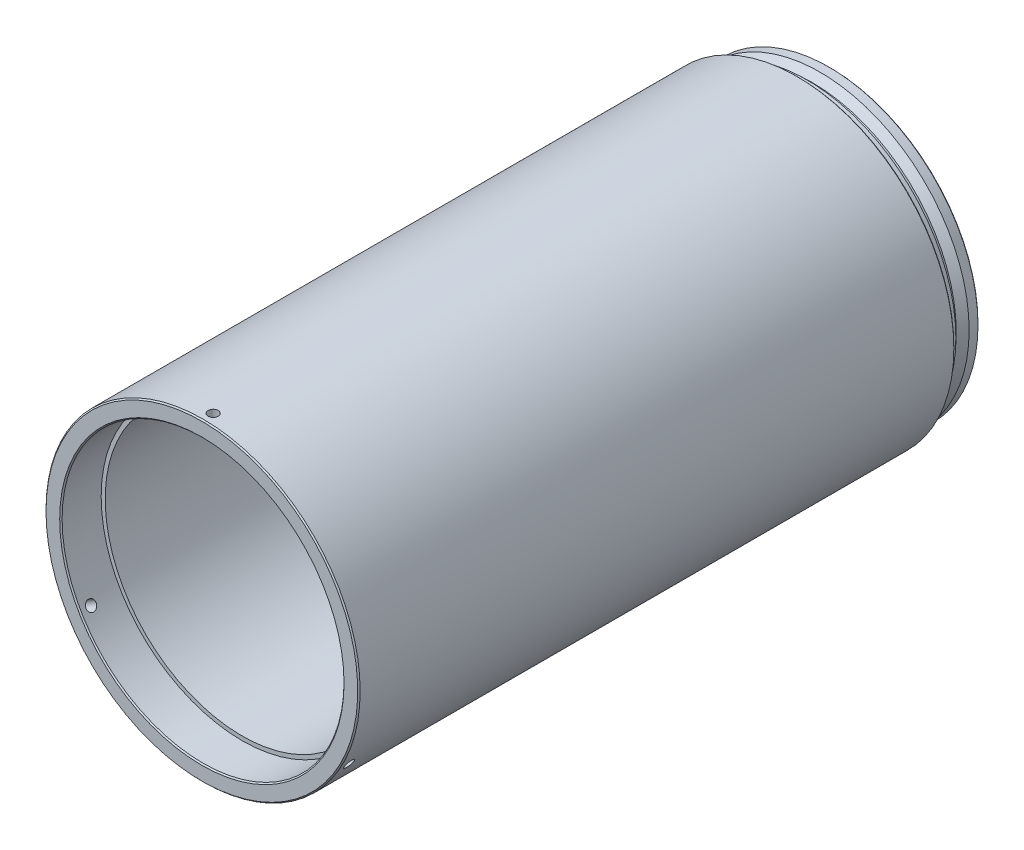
ISO-10303-21;
HEADER;
FILE_DESCRIPTION(('STEP AP214'),'2;1');
FILE_NAME('part.step','',(''),(''),'','','');
FILE_SCHEMA(('AUTOMOTIVE_DESIGN { 1 0 10303 214 1 1 1 1 }'));
ENDSEC;
DATA;
#1=APPLICATION_CONTEXT('core data for automotive mechanical design processes');
#2=APPLICATION_PROTOCOL_DEFINITION('international standard','automotive_design',2000,#1);
#3=PRODUCT_CONTEXT('',#1,'mechanical');
#4=PRODUCT('Part','Part','',(#3));
#5=PRODUCT_RELATED_PRODUCT_CATEGORY('part','',(#4));
#6=PRODUCT_DEFINITION_FORMATION('','',#4);
#7=PRODUCT_DEFINITION_CONTEXT('part definition',#1,'design');
#8=PRODUCT_DEFINITION('design','',#6,#7);
#9=PRODUCT_DEFINITION_SHAPE('','',#8);
#10=(LENGTH_UNIT() NAMED_UNIT(*) SI_UNIT(.MILLI.,.METRE.));
#11=(NAMED_UNIT(*) PLANE_ANGLE_UNIT() SI_UNIT($,.RADIAN.));
#12=(NAMED_UNIT(*) SI_UNIT($,.STERADIAN.) SOLID_ANGLE_UNIT());
#13=UNCERTAINTY_MEASURE_WITH_UNIT(LENGTH_MEASURE(1.E-05),#10,'distance_accuracy_value','');
#14=(GEOMETRIC_REPRESENTATION_CONTEXT(3) GLOBAL_UNCERTAINTY_ASSIGNED_CONTEXT((#13)) GLOBAL_UNIT_ASSIGNED_CONTEXT((#10,
#11,#12)) REPRESENTATION_CONTEXT('',''));
#15=CARTESIAN_POINT('',(0.,0.,0.));
#16=DIRECTION('',(0.,0.,1.));
#17=DIRECTION('',(1.,0.,0.));
#18=AXIS2_PLACEMENT_3D('',#15,#16,#17);
#19=CARTESIAN_POINT('',(0.,0.,-98.5429803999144));
#20=DIRECTION('',(0.,0.,1.));
#21=DIRECTION('',(1.,0.,0.));
#22=AXIS2_PLACEMENT_3D('',#19,#20,#21);
#23=CYLINDRICAL_SURFACE('',#22,35.);
#24=CARTESIAN_POINT('',(0.,0.,-81.584113));
#25=DIRECTION('',(0.,0.,-1.));
#26=DIRECTION('',(-1.,0.,0.));
#27=AXIS2_PLACEMENT_3D('',#24,#25,#26);
#28=CIRCLE('',#27,35.);
#29=CARTESIAN_POINT('',(-35.,0.,-81.584113));
#30=VERTEX_POINT('',#29);
#31=EDGE_CURVE('E9',#30,#30,#28,.F.);
#32=ORIENTED_EDGE('',*,*,#31,.T.);
#33=EDGE_LOOP('',(#32));
#34=FACE_BOUND('',#33,.T.);
#35=CARTESIAN_POINT('',(30.3108891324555,-17.4999999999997,-82.834113));
#36=CARTESIAN_POINT('',(30.2757943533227,-17.5607853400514,-82.8341161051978));
#37=CARTESIAN_POINT('',(30.240490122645,-17.6215078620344,-82.8400446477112));
#38=CARTESIAN_POINT('',(30.1705003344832,-17.7410745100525,-82.8636115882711));
#39=CARTESIAN_POINT('',(30.1358155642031,-17.7999163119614,-82.8812639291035));
#40=CARTESIAN_POINT('',(30.0681387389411,-17.9140009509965,-82.9277738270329));
#41=CARTESIAN_POINT('',(30.0351458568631,-17.9692455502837,-82.9566258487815));
#42=CARTESIAN_POINT('',(29.9718512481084,-18.0746207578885,-83.0247080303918));
#43=CARTESIAN_POINT('',(29.9415488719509,-18.1247526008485,-83.063935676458));
#44=CARTESIAN_POINT('',(29.8845544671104,-18.2185735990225,-83.151681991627));
#45=CARTESIAN_POINT('',(29.8578642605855,-18.2622595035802,-83.200205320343));
#46=CARTESIAN_POINT('',(29.8089607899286,-18.3419750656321,-83.305156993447));
#47=CARTESIAN_POINT('',(29.7867477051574,-18.3780044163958,-83.3615856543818));
#48=CARTESIAN_POINT('',(29.7475142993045,-18.4414421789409,-83.4807623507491));
#49=CARTESIAN_POINT('',(29.7304952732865,-18.4688484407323,-83.5435119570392));
#50=CARTESIAN_POINT('',(29.7022173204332,-18.5142919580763,-83.6735381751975));
#51=CARTESIAN_POINT('',(29.6909583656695,-18.5323292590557,-83.7408147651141));
#52=CARTESIAN_POINT('',(29.6745783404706,-18.5585463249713,-83.8779545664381));
#53=CARTESIAN_POINT('',(29.6694546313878,-18.5667303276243,-83.9478166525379));
#54=CARTESIAN_POINT('',(29.6655076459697,-18.5730361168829,-84.0881698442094));
#55=CARTESIAN_POINT('',(29.6666843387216,-18.5711579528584,-84.1586609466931));
#56=CARTESIAN_POINT('',(29.6752966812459,-18.5573929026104,-84.2982373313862));
#57=CARTESIAN_POINT('',(29.6827294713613,-18.5455105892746,-84.3673232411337));
#58=CARTESIAN_POINT('',(29.7036023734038,-18.5120607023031,-84.5021624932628));
#59=CARTESIAN_POINT('',(29.7170425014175,-18.4904931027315,-84.5679158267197));
#60=CARTESIAN_POINT('',(29.749489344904,-18.4382435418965,-84.6942407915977));
#61=CARTESIAN_POINT('',(29.7684973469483,-18.4075594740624,-84.7548112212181));
#62=CARTESIAN_POINT('',(29.8114576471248,-18.3379023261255,-84.869037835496));
#63=CARTESIAN_POINT('',(29.8354099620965,-18.2989292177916,-84.9226939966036));
#64=CARTESIAN_POINT('',(29.8875031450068,-18.2137213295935,-85.021600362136));
#65=CARTESIAN_POINT('',(29.9156463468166,-18.1674825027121,-85.0668458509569));
#66=CARTESIAN_POINT('',(29.9752220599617,-18.0690167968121,-85.1476102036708));
#67=CARTESIAN_POINT('',(30.0066545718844,-18.0167899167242,-85.1831290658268));
#68=CARTESIAN_POINT('',(30.0718370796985,-17.9077816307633,-85.2434314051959));
#69=CARTESIAN_POINT('',(30.1055871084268,-17.8510001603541,-85.26821473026));
#70=CARTESIAN_POINT('',(30.1743847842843,-17.7344601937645,-85.3063394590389));
#71=CARTESIAN_POINT('',(30.2094324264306,-17.6747017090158,-85.3196809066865));
#72=CARTESIAN_POINT('',(30.2797752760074,-17.553919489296,-85.3345373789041));
#73=CARTESIAN_POINT('',(30.3150703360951,-17.4928964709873,-85.3360589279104));
#74=CARTESIAN_POINT('',(30.3849206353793,-17.3712842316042,-85.3272494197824));
#75=CARTESIAN_POINT('',(30.4194758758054,-17.310695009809,-85.3169183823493));
#76=CARTESIAN_POINT('',(30.486883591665,-17.1917016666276,-85.2847023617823));
#77=CARTESIAN_POINT('',(30.5197365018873,-17.1332969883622,-85.2628203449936));
#78=CARTESIAN_POINT('',(30.58287253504,-17.0203436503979,-85.2081265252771));
#79=CARTESIAN_POINT('',(30.6131556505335,-16.9657950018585,-85.1753146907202));
#80=CARTESIAN_POINT('',(30.6703834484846,-16.8621200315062,-85.0996758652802));
#81=CARTESIAN_POINT('',(30.6973266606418,-16.8129960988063,-85.0568444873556));
#82=CARTESIAN_POINT('',(30.7471856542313,-16.7216413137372,-84.9623888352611));
#83=CARTESIAN_POINT('',(30.7701014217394,-16.6794104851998,-84.9107645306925));
#84=CARTESIAN_POINT('',(30.8113581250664,-16.6030750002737,-84.8001604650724));
#85=CARTESIAN_POINT('',(30.8296969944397,-16.5689740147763,-84.7411773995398));
#86=CARTESIAN_POINT('',(30.8613509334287,-16.5099408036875,-84.6175469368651));
#87=CARTESIAN_POINT('',(30.8746660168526,-16.4850085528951,-84.5528995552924));
#88=CARTESIAN_POINT('',(30.8959593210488,-16.4450665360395,-84.4197913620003));
#89=CARTESIAN_POINT('',(30.903938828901,-16.430054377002,-84.3513314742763));
#90=CARTESIAN_POINT('',(30.9143822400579,-16.4103959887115,-84.2125285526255));
#91=CARTESIAN_POINT('',(30.9168461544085,-16.405749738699,-84.1421855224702));
#92=CARTESIAN_POINT('',(30.9162021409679,-16.4069633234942,-84.0016551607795));
#93=CARTESIAN_POINT('',(30.9130973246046,-16.4128172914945,-83.9314677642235));
#94=CARTESIAN_POINT('',(30.9013929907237,-16.4348430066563,-83.7932016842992));
#95=CARTESIAN_POINT('',(30.8927934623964,-16.451014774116,-83.7251230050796));
#96=CARTESIAN_POINT('',(30.8702976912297,-16.4931891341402,-83.5930047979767));
#97=CARTESIAN_POINT('',(30.8564013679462,-16.5191918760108,-83.5289653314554));
#98=CARTESIAN_POINT('',(30.8236367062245,-16.5802477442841,-83.4067433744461));
#99=CARTESIAN_POINT('',(30.8047685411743,-16.6153005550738,-83.3485606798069));
#100=CARTESIAN_POINT('',(30.7624990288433,-16.693430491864,-83.2396721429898));
#101=CARTESIAN_POINT('',(30.7390956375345,-16.7365112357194,-83.1889696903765));
#102=CARTESIAN_POINT('',(30.6883239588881,-16.8294256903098,-83.0964980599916));
#103=CARTESIAN_POINT('',(30.6609546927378,-16.8792610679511,-83.0547310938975));
#104=CARTESIAN_POINT('',(30.6029261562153,-16.9842429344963,-82.9813060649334));
#105=CARTESIAN_POINT('',(30.572264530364,-17.0393932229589,-82.9496553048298));
#106=CARTESIAN_POINT('',(30.5084849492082,-17.1533259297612,-82.8974328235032));
#107=CARTESIAN_POINT('',(30.475369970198,-17.2121039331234,-82.8768479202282));
#108=CARTESIAN_POINT('',(30.4201818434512,-17.309373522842,-82.8527836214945));
#109=CARTESIAN_POINT('',(30.3985733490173,-17.3472955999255,-82.845790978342));
#110=CARTESIAN_POINT('',(30.3549672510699,-17.423486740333,-82.8364546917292));
#111=CARTESIAN_POINT('',(30.3329696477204,-17.4617558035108,-82.8341110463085));
#112=CARTESIAN_POINT('',(30.3108891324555,-17.4999999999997,-82.834113));
#113=B_SPLINE_CURVE_WITH_KNOTS('',3,(#35,#36,#37,#38,#39,#40,#41,#42,#43,#44,#45,#46,#47,#48,
#49,#50,#51,#52,#53,#54,#55,#56,#57,#58,#59,#60,#61,#62,#63,#64,#65,#66,#67,#68,#69,#70,#71,#72,
#73,#74,#75,#76,#77,#78,#79,#80,#81,#82,#83,#84,#85,#86,#87,#88,#89,#90,#91,#92,#93,#94,#95,#96,
#97,#98,#99,#100,#101,#102,#103,#104,#105,#106,#107,#108,#109,#110,#111,#112),.UNSPECIFIED.,.T.,
.F.,(4,2,2,2,2,2,2,2,2,2,2,2,2,2,2,2,2,2,2,2,2,2,2,2,2,2,2,2,2,2,2,2,2,2,2,2,2,2,4),(0.,
0.210405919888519,0.421062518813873,0.631615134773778,0.842116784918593,1.05272422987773,
1.26334011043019,1.4740084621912,1.68467579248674,1.89525248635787,2.1058281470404,
2.31630760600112,2.5267876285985,2.73731632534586,2.94784573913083,3.15849283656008,
3.36913997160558,3.57979009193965,3.79043940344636,4.00097243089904,4.21150510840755,
4.4219837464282,4.63246299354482,4.84303457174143,5.0536068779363,5.26427408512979,
5.47494071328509,5.68555650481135,5.89617187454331,6.10666960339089,6.31716774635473,
6.52766908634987,6.73816308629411,6.94875217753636,7.15939333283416,7.3701862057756,
7.58072741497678,7.71310816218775,7.84548885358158),.UNSPECIFIED.);
#114=CARTESIAN_POINT('',(30.3108891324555,-17.4999999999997,-82.834113));
#115=VERTEX_POINT('',#114);
#116=EDGE_CURVE('E210',#115,#115,#113,.T.);
#117=ORIENTED_EDGE('',*,*,#116,.T.);
#118=EDGE_LOOP('',(#117));
#119=FACE_BOUND('',#118,.T.);
#120=CARTESIAN_POINT('',(-30.3108891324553,-17.5000000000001,-82.834113));
#121=CARTESIAN_POINT('',(-30.3459833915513,-17.439214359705,-82.8341161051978));
#122=CARTESIAN_POINT('',(-30.3809185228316,-17.3782787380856,-82.8400446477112));
#123=CARTESIAN_POINT('',(-30.4494713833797,-17.257882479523,-82.8636115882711));
#124=CARTESIAN_POINT('',(-30.4830874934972,-17.1984236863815,-82.8812639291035));
#125=CARTESIAN_POINT('',(-30.5480492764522,-17.0827715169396,-82.9277738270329));
#126=CARTESIAN_POINT('',(-30.5793960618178,-17.0265765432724,-82.9566258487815));
#127=CARTESIAN_POINT('',(-30.6390063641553,-16.9190742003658,-83.0247080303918));
#128=CARTESIAN_POINT('',(-30.6672706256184,-16.8677656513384,-83.063935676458));
#129=CARTESIAN_POINT('',(-30.7200247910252,-16.771496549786,-83.151681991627));
#130=CARTESIAN_POINT('',(-30.7445127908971,-16.7265392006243,-83.200205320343));
#131=CARTESIAN_POINT('',(-30.7890967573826,-16.6443297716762,-83.305156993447));
#132=CARTESIAN_POINT('',(-30.8091925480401,-16.6070780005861,-83.3615856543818));
#133=CARTESIAN_POINT('',(-30.844514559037,-16.5413819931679,-83.4807623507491));
#134=CARTESIAN_POINT('',(-30.8597395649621,-16.512939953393,-83.5435119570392));
#135=CARTESIAN_POINT('',(-30.8849558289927,-16.4657287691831,-83.6735381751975));
#136=CARTESIAN_POINT('',(-30.8949471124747,-16.4469595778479,-83.7408147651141));
#137=CARTESIAN_POINT('',(-30.9094617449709,-16.4196655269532,-83.8779545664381));
#138=CARTESIAN_POINT('',(-30.9139874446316,-16.4111362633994,-83.9478166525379));
#139=CARTESIAN_POINT('',(-30.9174749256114,-16.4045651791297,-84.0881698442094));
#140=CARTESIAN_POINT('',(-30.9164367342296,-16.4065233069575,-84.1586609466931));
#141=CARTESIAN_POINT('',(-30.9088220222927,-16.4208643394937,-84.2982373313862));
#142=CARTESIAN_POINT('',(-30.9022480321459,-16.4332424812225,-84.3673232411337));
#143=CARTESIAN_POINT('',(-30.883716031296,-16.4680438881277,-84.5021624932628));
#144=CARTESIAN_POINT('',(-30.8717580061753,-16.4904671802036,-84.5679158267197));
#145=CARTESIAN_POINT('',(-30.8427319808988,-16.5446917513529,-84.6942407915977));
#146=CARTESIAN_POINT('',(-30.8256627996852,-16.5764951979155,-84.7548112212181));
#147=CARTESIAN_POINT('',(-30.7868180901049,-16.648528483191,-84.8690378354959));
#148=CARTESIAN_POINT('',(-30.7650425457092,-16.6887583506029,-84.9226939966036));
#149=CARTESIAN_POINT('',(-30.717296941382,-16.7764763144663,-85.021600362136));
#150=CARTESIAN_POINT('',(-30.6913245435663,-16.8239684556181,-85.0668458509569));
#151=CARTESIAN_POINT('',(-30.6358385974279,-16.9247953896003,-85.1476102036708));
#152=CARTESIAN_POINT('',(-30.6063250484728,-16.9781301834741,-85.1831290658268));
#153=CARTESIAN_POINT('',(-30.5445123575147,-17.0890840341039,-85.2434314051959));
#154=CARTESIAN_POINT('',(-30.5122131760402,-17.1467031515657,-85.26821473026));
#155=CARTESIAN_POINT('',(-30.4456854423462,-17.2645536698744,-85.3063394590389));
#156=CARTESIAN_POINT('',(-30.4114568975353,-17.3247850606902,-85.3196809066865));
#157=CARTESIAN_POINT('',(-30.3420278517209,-17.4460948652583,-85.3345373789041));
#158=CARTESIAN_POINT('',(-30.3068278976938,-17.5071727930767,-85.3360589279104));
#159=CARTESIAN_POINT('',(-30.236433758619,-17.6284710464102,-85.3272494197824));
#160=CARTESIAN_POINT('',(-30.2012395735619,-17.6886913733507,-85.3169183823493));
#161=CARTESIAN_POINT('',(-30.1318921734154,-17.8065648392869,-85.2847023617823));
#162=CARTESIAN_POINT('',(-30.0977386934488,-17.8642186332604,-85.2628203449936));
#163=CARTESIAN_POINT('',(-30.0314862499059,-17.9753727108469,-85.2081265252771));
#164=CARTESIAN_POINT('',(-29.9993872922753,-18.0288729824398,-85.1753146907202));
#165=CARTESIAN_POINT('',(-29.9382160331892,-18.1302711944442,-85.0996758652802));
#166=CARTESIAN_POINT('',(-29.9091450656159,-18.1781666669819,-85.0568444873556));
#167=CARTESIAN_POINT('',(-29.8549589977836,-18.267023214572,-84.9623888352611));
#168=CARTESIAN_POINT('',(-29.8298439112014,-18.30798426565,-84.9107645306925));
#169=CARTESIAN_POINT('',(-29.7843637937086,-18.3818813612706,-84.8001604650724));
#170=CARTESIAN_POINT('',(-29.7640009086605,-18.4148137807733,-84.7411773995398));
#171=CARTESIAN_POINT('',(-29.7287036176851,-18.471743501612,-84.6175469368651));
#172=CARTESIAN_POINT('',(-29.7137691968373,-18.4957408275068,-84.5528995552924));
#173=CARTESIAN_POINT('',(-29.6898250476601,-18.534152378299,-84.4197913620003));
#174=CARTESIAN_POINT('',(-29.6808138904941,-18.5485689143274,-84.3513314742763));
#175=CARTESIAN_POINT('',(-29.6690109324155,-18.5674423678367,-84.2125285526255));
#176=CARTESIAN_POINT('',(-29.6662191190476,-18.5718993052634,-84.1421855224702));
#177=CARTESIAN_POINT('',(-29.6669481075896,-18.5707347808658,-84.0016551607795));
#178=CARTESIAN_POINT('',(-29.6704653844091,-18.5651189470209,-83.9314677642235));
#179=CARTESIAN_POINT('',(-29.6836880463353,-18.5439698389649,-83.7932016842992));
#180=CARTESIAN_POINT('',(-29.6933934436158,-18.528436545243,-83.7251230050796));
#181=CARTESIAN_POINT('',(-29.7186696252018,-18.4878674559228,-83.5930047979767));
#182=CARTESIAN_POINT('',(-29.7342404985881,-18.4628315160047,-83.5289653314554));
#183=CARTESIAN_POINT('',(-29.770734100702,-18.4039285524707,-83.4067433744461));
#184=CARTESIAN_POINT('',(-29.7916566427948,-18.3700618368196,-83.3485606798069));
#185=CARTESIAN_POINT('',(-29.8381843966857,-18.2943903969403,-83.2396721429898));
#186=CARTESIAN_POINT('',(-29.863791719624,-18.2525820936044,-83.1889696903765));
#187=CARTESIAN_POINT('',(-29.9188721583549,-18.1621553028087,-83.0964980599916));
#188=CARTESIAN_POINT('',(-29.9483462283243,-18.113535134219,-83.0547310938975));
#189=CARTESIAN_POINT('',(-30.010248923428,-18.0107900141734,-82.9813060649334));
#190=CARTESIAN_POINT('',(-30.0426796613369,-17.9566611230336,-82.9496553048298));
#191=CARTESIAN_POINT('',(-30.1094584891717,-17.8444600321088,-82.8974328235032));
#192=CARTESIAN_POINT('',(-30.143804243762,-17.7863926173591,-82.8768479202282));
#193=CARTESIAN_POINT('',(-30.2004481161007,-17.6899635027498,-82.8527836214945));
#194=CARTESIAN_POINT('',(-30.2224853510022,-17.6522889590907,-82.845790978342));
#195=CARTESIAN_POINT('',(-30.2666657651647,-17.5764294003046,-82.8364546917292));
#196=CARTESIAN_POINT('',(-30.288808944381,-17.5382443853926,-82.8341110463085));
#197=CARTESIAN_POINT('',(-30.3108891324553,-17.5000000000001,-82.834113));
#198=B_SPLINE_CURVE_WITH_KNOTS('',3,(#120,#121,#122,#123,#124,#125,#126,#127,#128,#129,#130,
#131,#132,#133,#134,#135,#136,#137,#138,#139,#140,#141,#142,#143,#144,#145,#146,#147,#148,#149,
#150,#151,#152,#153,#154,#155,#156,#157,#158,#159,#160,#161,#162,#163,#164,#165,#166,#167,#168,
#169,#170,#171,#172,#173,#174,#175,#176,#177,#178,#179,#180,#181,#182,#183,#184,#185,#186,#187,
#188,#189,#190,#191,#192,#193,#194,#195,#196,#197),.UNSPECIFIED.,.T.,.F.,(4,2,2,2,2,2,2,2,2,2,2,
2,2,2,2,2,2,2,2,2,2,2,2,2,2,2,2,2,2,2,2,2,2,2,2,2,2,2,4),(0.,0.210405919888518,
0.421062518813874,0.631615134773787,0.842116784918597,1.05272422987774,1.26334011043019,
1.4740084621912,1.68467579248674,1.89525248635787,2.1058281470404,2.31630760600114,
2.52678762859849,2.73731632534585,2.94784573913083,3.15849283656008,3.36913997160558,
3.57979009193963,3.79043940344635,4.00097243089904,4.21150510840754,4.4219837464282,
4.63246299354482,4.84303457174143,5.0536068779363,5.2642740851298,5.47494071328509,
5.68555650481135,5.89617187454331,6.10666960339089,6.31716774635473,6.52766908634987,
6.73816308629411,6.94875217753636,7.15939333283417,7.37018620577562,7.58072741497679,
7.71310816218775,7.84548885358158),.UNSPECIFIED.);
#199=CARTESIAN_POINT('',(-30.3108891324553,-17.5000000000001,-82.834113));
#200=VERTEX_POINT('',#199);
#201=EDGE_CURVE('E184',#200,#200,#198,.T.);
#202=ORIENTED_EDGE('',*,*,#201,.T.);
#203=EDGE_LOOP('',(#202));
#204=FACE_BOUND('',#203,.T.);
#205=CARTESIAN_POINT('',(0.,35.,-82.834113));
#206=CARTESIAN_POINT('',(0.0701890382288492,34.9999996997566,-82.8341161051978));
#207=CARTESIAN_POINT('',(0.140428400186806,34.9997866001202,-82.8400446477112));
#208=CARTESIAN_POINT('',(0.278971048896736,34.9989569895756,-82.8636115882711));
#209=CARTESIAN_POINT('',(0.347271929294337,34.998339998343,-82.8812639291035));
#210=CARTESIAN_POINT('',(0.479910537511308,34.9967724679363,-82.9277738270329));
#211=CARTESIAN_POINT('',(0.544250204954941,34.9958220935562,-82.9566258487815));
#212=CARTESIAN_POINT('',(0.667155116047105,34.9936949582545,-83.0247080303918));
#213=CARTESIAN_POINT('',(0.72572175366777,34.992518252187,-83.063935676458));
#214=CARTESIAN_POINT('',(0.835470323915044,34.9900701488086,-83.151681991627));
#215=CARTESIAN_POINT('',(0.886648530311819,34.9887987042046,-83.200205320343));
#216=CARTESIAN_POINT('',(0.980135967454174,34.9863048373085,-83.305156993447));
#217=CARTESIAN_POINT('',(1.02244484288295,34.985082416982,-83.3615856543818));
#218=CARTESIAN_POINT('',(1.09700025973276,34.982824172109,-83.4807623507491));
#219=CARTESIAN_POINT('',(1.12924429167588,34.9817883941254,-83.5435119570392));
#220=CARTESIAN_POINT('',(1.18273850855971,34.9800207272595,-83.6735381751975));
#221=CARTESIAN_POINT('',(1.20398874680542,34.9792888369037,-83.7408147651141));
#222=CARTESIAN_POINT('',(1.23488340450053,34.9782118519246,-83.8779545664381));
#223=CARTESIAN_POINT('',(1.24453281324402,34.9778665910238,-83.9478166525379));
#224=CARTESIAN_POINT('',(1.25196727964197,34.9776012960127,-84.0881698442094));
#225=CARTESIAN_POINT('',(1.2497523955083,34.977681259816,-84.1586609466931));
#226=CARTESIAN_POINT('',(1.23352534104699,34.9782572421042,-84.2982373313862));
#227=CARTESIAN_POINT('',(1.21951856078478,34.9787530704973,-84.3673232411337));
#228=CARTESIAN_POINT('',(1.1801136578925,34.9801045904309,-84.5021624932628));
#229=CARTESIAN_POINT('',(1.15471550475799,34.9809602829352,-84.5679158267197));
#230=CARTESIAN_POINT('',(1.09324263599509,34.9829352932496,-84.6942407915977));
#231=CARTESIAN_POINT('',(1.05716545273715,34.9840546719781,-84.7548112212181));
#232=CARTESIAN_POINT('',(0.975360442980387,34.9864308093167,-84.869037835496));
#233=CARTESIAN_POINT('',(0.929632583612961,34.9876875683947,-84.9226939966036));
#234=CARTESIAN_POINT('',(0.829793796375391,34.99019764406,-85.021600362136));
#235=CARTESIAN_POINT('',(0.775678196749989,34.9914509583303,-85.0668458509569));
#236=CARTESIAN_POINT('',(0.660616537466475,34.9938121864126,-85.1476102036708));
#237=CARTESIAN_POINT('',(0.599670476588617,34.9949201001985,-85.1831290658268));
#238=CARTESIAN_POINT('',(0.472675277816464,34.9968656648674,-85.2434314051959));
#239=CARTESIAN_POINT('',(0.406626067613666,34.9977033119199,-85.26821473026));
#240=CARTESIAN_POINT('',(0.271300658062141,34.9990138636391,-85.3063394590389));
#241=CARTESIAN_POINT('',(0.202024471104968,34.9994867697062,-85.3196809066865));
#242=CARTESIAN_POINT('',(0.0622525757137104,35.0000143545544,-85.3345373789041));
#243=CARTESIAN_POINT('',(-0.0082424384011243,35.0000692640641,-85.3360589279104));
#244=CARTESIAN_POINT('',(-0.148486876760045,34.9997552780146,-85.3272494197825));
#245=CARTESIAN_POINT('',(-0.218236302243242,34.9993863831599,-85.3169183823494));
#246=CARTESIAN_POINT('',(-0.354991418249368,34.9982665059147,-85.2847023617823));
#247=CARTESIAN_POINT('',(-0.421997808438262,34.9975156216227,-85.2628203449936));
#248=CARTESIAN_POINT('',(-0.551386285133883,34.995716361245,-85.2081265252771));
#249=CARTESIAN_POINT('',(-0.613768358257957,34.9946679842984,-85.1753146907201));
#250=CARTESIAN_POINT('',(-0.73216741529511,34.9923912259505,-85.0996758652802));
#251=CARTESIAN_POINT('',(-0.788181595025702,34.9911627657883,-85.0568444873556));
#252=CARTESIAN_POINT('',(-0.892226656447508,34.9886645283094,-84.9623888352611));
#253=CARTESIAN_POINT('',(-0.940257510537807,34.9873947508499,-84.9107645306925));
#254=CARTESIAN_POINT('',(-1.02699433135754,34.9849563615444,-84.8001604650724));
#255=CARTESIAN_POINT('',(-1.06569608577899,34.9837877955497,-84.7411773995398));
#256=CARTESIAN_POINT('',(-1.13264731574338,34.9816843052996,-84.6175469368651));
#257=CARTESIAN_POINT('',(-1.16089682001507,34.980749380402,-84.5528995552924));
#258=CARTESIAN_POINT('',(-1.20613427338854,34.9792189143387,-84.4197913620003));
#259=CARTESIAN_POINT('',(-1.22312493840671,34.9786232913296,-84.3513314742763));
#260=CARTESIAN_POINT('',(-1.24537130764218,34.9778383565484,-84.2125285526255));
#261=CARTESIAN_POINT('',(-1.25062703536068,34.9776490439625,-84.1421855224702));
#262=CARTESIAN_POINT('',(-1.2492540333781,34.9776981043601,-84.0016551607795));
#263=CARTESIAN_POINT('',(-1.2426319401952,34.9779362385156,-83.9314677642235));
#264=CARTESIAN_POINT('',(-1.2177049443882,34.9788128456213,-83.7932016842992));
#265=CARTESIAN_POINT('',(-1.19940001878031,34.9794513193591,-83.7251230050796));
#266=CARTESIAN_POINT('',(-1.15162806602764,34.9810565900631,-83.5930047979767));
#267=CARTESIAN_POINT('',(-1.12216086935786,34.9820233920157,-83.5289653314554));
#268=CARTESIAN_POINT('',(-1.05290260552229,34.984176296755,-83.4067433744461));
#269=CARTESIAN_POINT('',(-1.01311189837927,34.9853623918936,-83.3485606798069));
#270=CARTESIAN_POINT('',(-0.924314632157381,34.9878208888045,-83.2396721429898));
#271=CARTESIAN_POINT('',(-0.875303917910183,34.989093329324,-83.1889696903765));
#272=CARTESIAN_POINT('',(-0.769451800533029,34.9915809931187,-83.0964980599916));
#273=CARTESIAN_POINT('',(-0.71260846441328,34.9927962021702,-83.0547310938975));
#274=CARTESIAN_POINT('',(-0.592677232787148,34.9950329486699,-82.9813060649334));
#275=CARTESIAN_POINT('',(-0.529584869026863,34.9960543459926,-82.9496553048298));
#276=CARTESIAN_POINT('',(-0.399026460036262,34.9977859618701,-82.8974328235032));
#277=CARTESIAN_POINT('',(-0.331565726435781,34.9984965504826,-82.8768479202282));
#278=CARTESIAN_POINT('',(-0.219733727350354,34.9993370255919,-82.8527836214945));
#279=CARTESIAN_POINT('',(-0.176087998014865,34.9995845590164,-82.845790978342));
#280=CARTESIAN_POINT('',(-0.0883014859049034,34.9999161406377,-82.8364546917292));
#281=CARTESIAN_POINT('',(-0.0441607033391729,35.0000001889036,-82.8341110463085));
#282=CARTESIAN_POINT('',(0.,35.,-82.834113));
#283=B_SPLINE_CURVE_WITH_KNOTS('',3,(#205,#206,#207,#208,#209,#210,#211,#212,#213,#214,#215,
#216,#217,#218,#219,#220,#221,#222,#223,#224,#225,#226,#227,#228,#229,#230,#231,#232,#233,#234,
#235,#236,#237,#238,#239,#240,#241,#242,#243,#244,#245,#246,#247,#248,#249,#250,#251,#252,#253,
#254,#255,#256,#257,#258,#259,#260,#261,#262,#263,#264,#265,#266,#267,#268,#269,#270,#271,#272,
#273,#274,#275,#276,#277,#278,#279,#280,#281,#282),.UNSPECIFIED.,.T.,.F.,(4,2,2,2,2,2,2,2,2,2,2,
2,2,2,2,2,2,2,2,2,2,2,2,2,2,2,2,2,2,2,2,2,2,2,2,2,2,2,4),(0.,0.210405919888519,
0.421062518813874,0.631615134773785,0.842116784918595,1.05272422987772,1.26334011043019,
1.47400846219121,1.68467579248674,1.89525248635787,2.1058281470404,2.31630760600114,
2.5267876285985,2.73731632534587,2.94784573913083,3.15849283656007,3.36913997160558,
3.57979009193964,3.79043940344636,4.00097243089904,4.21150510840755,4.42198374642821,
4.63246299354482,4.84303457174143,5.0536068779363,5.2642740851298,5.47494071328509,
5.68555650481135,5.89617187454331,6.10666960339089,6.31716774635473,6.52766908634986,
6.73816308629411,6.94875217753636,7.15939333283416,7.3701862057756,7.58072741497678,
7.71310816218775,7.84548885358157),.UNSPECIFIED.);
#284=CARTESIAN_POINT('',(0.,35.,-82.834113));
#285=VERTEX_POINT('',#284);
#286=EDGE_CURVE('E81',#285,#285,#283,.T.);
#287=ORIENTED_EDGE('',*,*,#286,.T.);
#288=EDGE_LOOP('',(#287));
#289=FACE_BOUND('',#288,.T.);
#290=CARTESIAN_POINT('',(0.,0.,-91.284113));
#291=DIRECTION('',(0.,0.,1.));
#292=DIRECTION('',(1.,0.,0.));
#293=AXIS2_PLACEMENT_3D('',#290,#291,#292);
#294=CIRCLE('',#293,35.);
#295=CARTESIAN_POINT('',(35.,0.,-91.284113));
#296=VERTEX_POINT('',#295);
#297=EDGE_CURVE('E70',#296,#296,#294,.T.);
#298=ORIENTED_EDGE('',*,*,#297,.F.);
#299=EDGE_LOOP('',(#298));
#300=FACE_BOUND('',#299,.T.);
#301=ADVANCED_FACE('F14',(#34,#119,#204,#289,#300),#23,.F.);
#302=CARTESIAN_POINT('',(0.,35.,-81.284113));
#303=DIRECTION('',(0.,0.,-1.));
#304=DIRECTION('',(-1.,0.,0.));
#305=AXIS2_PLACEMENT_3D('',#302,#303,#304);
#306=PLANE('',#305);
#307=CARTESIAN_POINT('',(0.,0.,-81.284113));
#308=DIRECTION('',(0.,0.,-1.));
#309=DIRECTION('',(-1.,0.,0.));
#310=AXIS2_PLACEMENT_3D('',#307,#308,#309);
#311=CIRCLE('',#310,38.7);
#312=CARTESIAN_POINT('',(-38.7,0.,-81.284113));
#313=VERTEX_POINT('',#312);
#314=EDGE_CURVE('E21',#313,#313,#311,.F.);
#315=ORIENTED_EDGE('',*,*,#314,.T.);
#316=EDGE_LOOP('',(#315));
#317=FACE_BOUND('',#316,.T.);
#318=CARTESIAN_POINT('',(0.,0.,-81.284113));
#319=DIRECTION('',(0.,0.,-1.));
#320=DIRECTION('',(-1.,0.,0.));
#321=AXIS2_PLACEMENT_3D('',#318,#319,#320);
#322=CIRCLE('',#321,35.3);
#323=CARTESIAN_POINT('',(-35.3,0.,-81.284113));
#324=VERTEX_POINT('',#323);
#325=EDGE_CURVE('E25',#324,#324,#322,.T.);
#326=ORIENTED_EDGE('',*,*,#325,.T.);
#327=EDGE_LOOP('',(#326));
#328=FACE_BOUND('',#327,.T.);
#329=ADVANCED_FACE('F140',(#317,#328),#306,.F.);
#330=CARTESIAN_POINT('',(0.,0.,-98.5429803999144));
#331=DIRECTION('',(0.,0.,1.));
#332=DIRECTION('',(1.,0.,0.));
#333=AXIS2_PLACEMENT_3D('',#330,#331,#332);
#334=CYLINDRICAL_SURFACE('',#333,39.);
#335=CARTESIAN_POINT('',(0.,0.,-228.988506));
#336=DIRECTION('',(0.,0.,1.));
#337=DIRECTION('',(1.,0.,0.));
#338=AXIS2_PLACEMENT_3D('',#335,#336,#337);
#339=CIRCLE('',#338,39.);
#340=CARTESIAN_POINT('',(39.,0.,-228.988506));
#341=VERTEX_POINT('',#340);
#342=EDGE_CURVE('E40',#341,#341,#339,.T.);
#343=ORIENTED_EDGE('',*,*,#342,.T.);
#344=EDGE_LOOP('',(#343));
#345=FACE_BOUND('',#344,.T.);
#346=CARTESIAN_POINT('',(0.,0.,-81.584113));
#347=DIRECTION('',(0.,0.,-1.));
#348=DIRECTION('',(-1.,0.,0.));
#349=AXIS2_PLACEMENT_3D('',#346,#347,#348);
#350=CIRCLE('',#349,39.);
#351=CARTESIAN_POINT('',(-39.,0.,-81.584113));
#352=VERTEX_POINT('',#351);
#353=EDGE_CURVE('E43',#352,#352,#350,.T.);
#354=ORIENTED_EDGE('',*,*,#353,.T.);
#355=EDGE_LOOP('',(#354));
#356=FACE_BOUND('',#355,.T.);
#357=CARTESIAN_POINT('',(33.7749907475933,-19.4999999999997,-82.834113));
#358=CARTESIAN_POINT('',(33.8100873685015,-19.4392103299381,-82.8341161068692));
#359=CARTESIAN_POINT('',(33.8450437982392,-19.3782814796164,-82.8400454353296));
#360=CARTESIAN_POINT('',(33.913675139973,-19.2579192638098,-82.8636156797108));
#361=CARTESIAN_POINT('',(33.9473484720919,-19.1984877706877,-82.8812705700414));
#362=CARTESIAN_POINT('',(34.0124543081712,-19.0829072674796,-82.9277876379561));
#363=CARTESIAN_POINT('',(34.043887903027,-19.0267566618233,-82.9566443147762));
#364=CARTESIAN_POINT('',(34.1036914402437,-18.9193555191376,-83.0247378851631));
#365=CARTESIAN_POINT('',(34.1320621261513,-18.8681037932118,-83.0639722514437));
#366=CARTESIAN_POINT('',(34.1850346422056,-18.7719584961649,-83.151730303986));
#367=CARTESIAN_POINT('',(34.2096348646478,-18.7270676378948,-83.2002579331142));
#368=CARTESIAN_POINT('',(34.2544384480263,-18.6449896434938,-83.3052179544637));
#369=CARTESIAN_POINT('',(34.2746416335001,-18.607802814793,-83.3616506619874));
#370=CARTESIAN_POINT('',(34.3101604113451,-18.5422298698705,-83.480831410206));
#371=CARTESIAN_POINT('',(34.3254750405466,-18.5138454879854,-83.5435806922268));
#372=CARTESIAN_POINT('',(34.3508437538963,-18.4667336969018,-83.6736045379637));
#373=CARTESIAN_POINT('',(34.3608978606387,-18.4480062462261,-83.7408790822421));
#374=CARTESIAN_POINT('',(34.3755048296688,-18.4207738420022,-83.878019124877));
#375=CARTESIAN_POINT('',(34.3800595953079,-18.4122653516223,-83.9478837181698));
#376=CARTESIAN_POINT('',(34.3835670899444,-18.4057145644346,-84.0882411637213));
#377=CARTESIAN_POINT('',(34.3825198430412,-18.4076722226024,-84.1587340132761));
#378=CARTESIAN_POINT('',(34.3748493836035,-18.4219921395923,-84.2983196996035));
#379=CARTESIAN_POINT('',(34.36822822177,-18.4343505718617,-84.367413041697));
#380=CARTESIAN_POINT('',(34.3495685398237,-18.4690965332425,-84.5022660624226));
#381=CARTESIAN_POINT('',(34.33753000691,-18.4914840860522,-84.568025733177));
#382=CARTESIAN_POINT('',(34.3083188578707,-18.545624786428,-84.6943586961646));
#383=CARTESIAN_POINT('',(34.2911452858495,-18.5773796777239,-84.7549310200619));
#384=CARTESIAN_POINT('',(34.2520788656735,-18.649309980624,-84.8691592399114));
#385=CARTESIAN_POINT('',(34.2301860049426,-18.6894854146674,-84.9228151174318));
#386=CARTESIAN_POINT('',(34.182208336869,-18.7770903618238,-85.0217126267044));
#387=CARTESIAN_POINT('',(34.1561216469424,-18.8245231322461,-85.0669504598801));
#388=CARTESIAN_POINT('',(34.1004208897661,-18.9252371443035,-85.1476984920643));
#389=CARTESIAN_POINT('',(34.0708068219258,-18.978518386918,-85.1832086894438));
#390=CARTESIAN_POINT('',(34.0088182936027,-19.0893768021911,-85.2434930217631));
#391=CARTESIAN_POINT('',(33.9764438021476,-19.1469540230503,-85.2682670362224));
#392=CARTESIAN_POINT('',(33.9097989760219,-19.2647374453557,-85.3063733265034));
#393=CARTESIAN_POINT('',(33.8755286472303,-19.3249436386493,-85.3197056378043));
#394=CARTESIAN_POINT('',(33.8060503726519,-19.4462294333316,-85.3345454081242));
#395=CARTESIAN_POINT('',(33.770842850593,-19.5073086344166,-85.3360581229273));
#396=CARTESIAN_POINT('',(33.7004719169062,-19.6286298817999,-85.3272294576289));
#397=CARTESIAN_POINT('',(33.6653085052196,-19.6888719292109,-85.3168880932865));
#398=CARTESIAN_POINT('',(33.5960555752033,-19.8068101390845,-85.2846491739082));
#399=CARTESIAN_POINT('',(33.5619658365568,-19.8645068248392,-85.2627540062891));
#400=CARTESIAN_POINT('',(33.4958685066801,-19.9757599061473,-85.2080314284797));
#401=CARTESIAN_POINT('',(33.4638609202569,-20.0293162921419,-85.1752039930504));
#402=CARTESIAN_POINT('',(33.4028926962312,-20.1308288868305,-85.099535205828));
#403=CARTESIAN_POINT('',(33.3739331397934,-20.1787831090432,-85.0566903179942));
#404=CARTESIAN_POINT('',(33.3199750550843,-20.2677570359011,-84.9622080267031));
#405=CARTESIAN_POINT('',(33.2949765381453,-20.3087767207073,-84.910570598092));
#406=CARTESIAN_POINT('',(33.2497241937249,-20.3827801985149,-84.7999464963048));
#407=CARTESIAN_POINT('',(33.2294720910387,-20.4157610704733,-84.7409571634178));
#408=CARTESIAN_POINT('',(33.1943761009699,-20.4727751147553,-84.617317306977));
#409=CARTESIAN_POINT('',(33.1795322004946,-20.4968083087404,-84.5526667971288));
#410=CARTESIAN_POINT('',(33.1557384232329,-20.5352751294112,-84.4195525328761));
#411=CARTESIAN_POINT('',(33.1467873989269,-20.5497106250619,-84.3510895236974));
#412=CARTESIAN_POINT('',(33.135068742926,-20.5686009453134,-84.2122831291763));
#413=CARTESIAN_POINT('',(33.1323011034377,-20.5730557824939,-84.1419397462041));
#414=CARTESIAN_POINT('',(33.1330403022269,-20.571865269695,-84.0014033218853));
#415=CARTESIAN_POINT('',(33.1365443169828,-20.5662244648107,-83.9312102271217));
#416=CARTESIAN_POINT('',(33.1497058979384,-20.5450031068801,-83.7929351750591));
#417=CARTESIAN_POINT('',(33.1593634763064,-20.5294225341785,-83.724853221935));
#418=CARTESIAN_POINT('',(33.184515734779,-20.4887404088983,-83.5927311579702));
#419=CARTESIAN_POINT('',(33.2000105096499,-20.4636387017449,-83.5286911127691));
#420=CARTESIAN_POINT('',(33.2363330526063,-20.4045916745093,-83.4064714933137));
#421=CARTESIAN_POINT('',(33.2571606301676,-20.3706466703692,-83.3482917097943));
#422=CARTESIAN_POINT('',(33.3034884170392,-20.2948177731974,-83.2394191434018));
#423=CARTESIAN_POINT('',(33.3289902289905,-20.2529311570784,-83.1887289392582));
#424=CARTESIAN_POINT('',(33.3838634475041,-20.1623525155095,-83.096284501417));
#425=CARTESIAN_POINT('',(33.4132358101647,-20.1136588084,-83.0545324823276));
#426=CARTESIAN_POINT('',(33.4749490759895,-20.0107816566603,-82.9811415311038));
#427=CARTESIAN_POINT('',(33.5072919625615,-19.9565945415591,-82.9495094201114));
#428=CARTESIAN_POINT('',(33.5739205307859,-19.8442965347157,-82.8973248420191));
#429=CARTESIAN_POINT('',(33.6082038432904,-19.7861904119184,-82.8767591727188));
#430=CARTESIAN_POINT('',(33.6647463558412,-19.6897618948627,-82.8527369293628));
#431=CARTESIAN_POINT('',(33.6867344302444,-19.6521206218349,-82.8457617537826));
#432=CARTESIAN_POINT('',(33.7308303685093,-19.5763378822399,-82.8364488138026));
#433=CARTESIAN_POINT('',(33.7529382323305,-19.5381964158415,-82.8341110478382));
#434=CARTESIAN_POINT('',(33.7749907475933,-19.4999999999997,-82.834113));
#435=B_SPLINE_CURVE_WITH_KNOTS('',3,(#357,#358,#359,#360,#361,#362,#363,#364,#365,#366,#367,
#368,#369,#370,#371,#372,#373,#374,#375,#376,#377,#378,#379,#380,#381,#382,#383,#384,#385,#386,
#387,#388,#389,#390,#391,#392,#393,#394,#395,#396,#397,#398,#399,#400,#401,#402,#403,#404,#405,
#406,#407,#408,#409,#410,#411,#412,#413,#414,#415,#416,#417,#418,#419,#420,#421,#422,#423,#424,
#425,#426,#427,#428,#429,#430,#431,#432,#433,#434),.UNSPECIFIED.,.T.,.F.,(4,2,2,2,2,2,2,2,2,2,2,
2,2,2,2,2,2,2,2,2,2,2,2,2,2,2,2,2,2,2,2,2,2,2,2,2,2,2,4),(0.,0.21042013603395,0.421091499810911,
0.631659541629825,0.842176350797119,1.0527826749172,1.26339740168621,1.47405359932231,
1.68470889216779,1.89529125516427,2.10587271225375,2.3163767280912,2.52688124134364,
2.73742496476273,2.94796924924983,3.15860831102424,3.36924740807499,3.57988886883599,
3.79052967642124,4.00107681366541,4.21162367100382,4.42212703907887,4.63263089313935,
4.84320916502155,5.05378803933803,5.2644433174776,5.47509808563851,5.68571182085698,
5.89632529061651,6.10684396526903,6.31736305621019,6.52788556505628,6.738400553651,
6.94898785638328,7.15962727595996,7.37040837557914,7.58093745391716,7.71315231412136,
7.84536712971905),.UNSPECIFIED.);
#436=CARTESIAN_POINT('',(33.7749907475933,-19.4999999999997,-82.834113));
#437=VERTEX_POINT('',#436);
#438=EDGE_CURVE('E176',#437,#437,#435,.T.);
#439=ORIENTED_EDGE('',*,*,#438,.T.);
#440=EDGE_LOOP('',(#439));
#441=FACE_BOUND('',#440,.T.);
#442=CARTESIAN_POINT('',(-33.774990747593,-19.5000000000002,-82.834113));
#443=CARTESIAN_POINT('',(-33.7398936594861,-19.5607894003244,-82.8341161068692));
#444=CARTESIAN_POINT('',(-33.7046059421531,-19.6215269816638,-82.8400454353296));
#445=CARTESIAN_POINT('',(-33.6346848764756,-19.7411445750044,-82.8636156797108));
#446=CARTESIAN_POINT('',(-33.6000523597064,-19.8000222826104,-82.8812705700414));
#447=CARTESIAN_POINT('',(-33.5325096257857,-19.9141958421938,-82.9277876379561));
#448=CARTESIAN_POINT('',(-33.4995985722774,-19.9694934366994,-82.9566443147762));
#449=CARTESIAN_POINT('',(-33.4364882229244,-20.074985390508,-83.0247378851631));
#450=CARTESIAN_POINT('',(-33.4062882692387,-20.1251809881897,-83.0639722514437));
#451=CARTESIAN_POINT('',(-33.3495102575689,-20.2191291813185,-83.151730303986));
#452=CARTESIAN_POINT('',(-33.3229337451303,-20.2628790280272,-83.2002579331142));
#453=CARTESIAN_POINT('',(-33.2742539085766,-20.3427190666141,-83.3052179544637));
#454=CARTESIAN_POINT('',(-33.2521507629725,-20.3788089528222,-83.3616506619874));
#455=CARTESIAN_POINT('',(-33.2131223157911,-20.4423555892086,-83.480831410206));
#456=CARTESIAN_POINT('',(-33.1961980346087,-20.4698106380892,-83.5435806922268));
#457=CARTESIAN_POINT('',(-33.1680823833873,-20.5153364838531,-83.6736045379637));
#458=CARTESIAN_POINT('',(-33.1568909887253,-20.5334073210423,-83.7408790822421));
#459=CARTESIAN_POINT('',(-33.1406105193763,-20.5596735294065,-83.878019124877));
#460=CARTESIAN_POINT('',(-33.135519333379,-20.5678723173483,-83.9478837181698));
#461=CARTESIAN_POINT('',(-33.1315999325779,-20.574185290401,-84.0882411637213));
#462=CARTESIAN_POINT('',(-33.1327716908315,-20.5722995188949,-84.1587340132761));
#463=CARTESIAN_POINT('',(-33.141337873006,-20.5584967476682,-84.2983196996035));
#464=CARTESIAN_POINT('',(-33.1487300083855,-20.5465834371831,-84.367413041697));
#465=CARTESIAN_POINT('',(-33.1694910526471,-20.5130506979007,-84.5022660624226));
#466=CARTESIAN_POINT('',(-33.182859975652,-20.4914312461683,-84.568025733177));
#467=CARTESIAN_POINT('',(-33.2151416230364,-20.4390632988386,-84.6943586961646));
#468=CARTESIAN_POINT('',(-33.2340553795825,-20.4083131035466,-84.7549310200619));
#469=CARTESIAN_POINT('',(-33.2768156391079,-20.3385154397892,-84.8691592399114));
#470=CARTESIAN_POINT('',(-33.3006621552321,-20.299467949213,-84.9228151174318));
#471=CARTESIAN_POINT('',(-33.3525414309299,-20.2141155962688,-85.0217126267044));
#472=CARTESIAN_POINT('',(-33.3805760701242,-20.1678074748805,-85.0669504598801));
#473=CARTESIAN_POINT('',(-33.4399465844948,-20.0692121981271,-85.1476984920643));
#474=CARTESIAN_POINT('',(-33.471282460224,-20.0169250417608,-85.1832086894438));
#475=CARTESIAN_POINT('',(-33.5362943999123,-19.9078121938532,-85.2434930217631));
#476=CARTESIAN_POINT('',(-33.5699704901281,-19.8509864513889,-85.2682670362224));
#477=CARTESIAN_POINT('',(-33.6386515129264,-19.7343786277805,-85.3063733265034));
#478=CARTESIAN_POINT('',(-33.673656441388,-19.6745965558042,-85.3197056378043));
#479=CARTESIAN_POINT('',(-33.7439538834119,-19.553783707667,-85.3345454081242));
#480=CARTESIAN_POINT('',(-33.7792462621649,-19.4927534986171,-85.3360581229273));
#481=CARTESIAN_POINT('',(-33.8491280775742,-19.3711498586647,-85.3272294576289));
#482=CARTESIAN_POINT('',(-33.8837175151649,-19.3105764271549,-85.3168880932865));
#483=CARTESIAN_POINT('',(-33.9512285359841,-19.1916325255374,-85.2846491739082));
#484=CARTESIAN_POINT('',(-33.9841504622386,-19.1332616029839,-85.2627540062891));
#485=CARTESIAN_POINT('',(-34.0474497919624,-19.0203930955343,-85.2080314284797));
#486=CARTESIAN_POINT('',(-34.077827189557,-18.9658955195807,-85.1752039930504));
#487=CARTESIAN_POINT('',(-34.1352555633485,-18.8623391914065,-85.099535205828));
#488=CARTESIAN_POINT('',(-34.1623053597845,-18.8132823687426,-85.0566903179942));
#489=CARTESIAN_POINT('',(-34.2123799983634,-18.7220663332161,-84.9622080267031));
#490=CARTESIAN_POINT('',(-34.2354048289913,-18.6799071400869,-84.910570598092));
#491=CARTESIAN_POINT('',(-34.2768675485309,-18.6037157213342,-84.7999464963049));
#492=CARTESIAN_POINT('',(-34.2953037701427,-18.5696864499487,-84.7409571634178));
#493=CARTESIAN_POINT('',(-34.327131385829,-18.5107854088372,-84.617317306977));
#494=CARTESIAN_POINT('',(-34.3405227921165,-18.4859136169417,-84.5526667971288));
#495=CARTESIAN_POINT('',(-34.3619391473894,-18.4460741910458,-84.4195525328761));
#496=CARTESIAN_POINT('',(-34.3699651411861,-18.4311046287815,-84.3510895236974));
#497=CARTESIAN_POINT('',(-34.3804653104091,-18.4115108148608,-84.2122831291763));
#498=CARTESIAN_POINT('',(-34.3829394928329,-18.4068865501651,-84.1419397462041));
#499=CARTESIAN_POINT('',(-34.3822780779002,-18.4081219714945,-84.0014033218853));
#500=CARTESIAN_POINT('',(-34.3791450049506,-18.4139769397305,-83.9312102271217));
#501=CARTESIAN_POINT('',(-34.3673475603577,-18.4359858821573,-83.7929351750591));
#502=CARTESIAN_POINT('',(-34.3586831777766,-18.4521398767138,-83.724853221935));
#503=CARTESIAN_POINT('',(-34.3360275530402,-18.4942634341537,-83.5927311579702));
#504=CARTESIAN_POINT('',(-34.3220362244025,-18.5202331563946,-83.5286911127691));
#505=CARTESIAN_POINT('',(-34.2890612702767,-18.5812129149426,-83.4064714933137));
#506=CARTESIAN_POINT('',(-34.2700778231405,-18.6162226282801,-83.3482917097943));
#507=CARTESIAN_POINT('',(-34.2275719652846,-18.6942581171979,-83.2394191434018));
#508=CARTESIAN_POINT('',(-34.2040479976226,-18.7372866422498,-83.1887289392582));
#509=CARTESIAN_POINT('',(-34.1530412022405,-18.8300975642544,-83.096284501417));
#510=CARTESIAN_POINT('',(-34.1255573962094,-18.8798816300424,-83.0545324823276));
#511=CARTESIAN_POINT('',(-34.0673198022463,-18.984765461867,-82.9811415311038));
#512=CARTESIAN_POINT('',(-34.0365638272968,-19.0398687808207,-82.9495094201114));
#513=CARTESIAN_POINT('',(-33.9726251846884,-19.1537198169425,-82.8973248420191));
#514=CARTESIAN_POINT('',(-33.9394454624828,-19.2124630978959,-82.8767591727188));
#515=CARTESIAN_POINT('',(-33.8842071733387,-19.3096446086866,-82.8527369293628));
#516=CARTESIAN_POINT('',(-33.8626029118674,-19.347507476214,-82.8457617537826));
#517=CARTESIAN_POINT('',(-33.8190211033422,-19.4235870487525,-82.8364488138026));
#518=CARTESIAN_POINT('',(-33.7970435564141,-19.4618037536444,-82.8341110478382));
#519=CARTESIAN_POINT('',(-33.774990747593,-19.5000000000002,-82.834113));
#520=B_SPLINE_CURVE_WITH_KNOTS('',3,(#442,#443,#444,#445,#446,#447,#448,#449,#450,#451,#452,
#453,#454,#455,#456,#457,#458,#459,#460,#461,#462,#463,#464,#465,#466,#467,#468,#469,#470,#471,
#472,#473,#474,#475,#476,#477,#478,#479,#480,#481,#482,#483,#484,#485,#486,#487,#488,#489,#490,
#491,#492,#493,#494,#495,#496,#497,#498,#499,#500,#501,#502,#503,#504,#505,#506,#507,#508,#509,
#510,#511,#512,#513,#514,#515,#516,#517,#518,#519),.UNSPECIFIED.,.T.,.F.,(4,2,2,2,2,2,2,2,2,2,2,
2,2,2,2,2,2,2,2,2,2,2,2,2,2,2,2,2,2,2,2,2,2,2,2,2,2,2,4),(0.,0.210420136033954,0.42109149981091,
0.631659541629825,0.842176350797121,1.0527826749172,1.26339740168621,1.47405359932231,
1.68470889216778,1.89529125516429,2.10587271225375,2.3163767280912,2.52688124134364,
2.73742496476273,2.94796924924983,3.15860831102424,3.36924740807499,3.579888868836,
3.79052967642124,4.00107681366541,4.21162367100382,4.42212703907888,4.63263089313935,
4.84320916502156,5.05378803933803,5.26444331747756,5.47509808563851,5.68571182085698,
5.89632529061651,6.10684396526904,6.31736305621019,6.52788556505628,6.738400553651,
6.94898785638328,7.15962727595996,7.37040837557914,7.58093745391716,7.71315231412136,
7.84536712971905),.UNSPECIFIED.);
#521=CARTESIAN_POINT('',(-33.774990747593,-19.5000000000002,-82.834113));
#522=VERTEX_POINT('',#521);
#523=EDGE_CURVE('E180',#522,#522,#520,.T.);
#524=ORIENTED_EDGE('',*,*,#523,.T.);
#525=EDGE_LOOP('',(#524));
#526=FACE_BOUND('',#525,.T.);
#527=CARTESIAN_POINT('',(0.,39.,-82.834113));
#528=CARTESIAN_POINT('',(-0.0701937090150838,38.9999997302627,-82.8341161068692));
#529=CARTESIAN_POINT('',(-0.140437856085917,38.9998084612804,-82.8400454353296));
#530=CARTESIAN_POINT('',(-0.278990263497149,38.9990638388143,-82.8636156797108));
#531=CARTESIAN_POINT('',(-0.347296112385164,38.9985100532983,-82.8812705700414));
#532=CARTESIAN_POINT('',(-0.479944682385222,38.9971031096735,-82.9277876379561));
#533=CARTESIAN_POINT('',(-0.544289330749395,38.9962500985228,-82.9566443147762));
#534=CARTESIAN_POINT('',(-0.667203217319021,38.9943409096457,-83.0247378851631));
#535=CARTESIAN_POINT('',(-0.725773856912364,38.9932847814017,-83.0639722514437));
#536=CARTESIAN_POINT('',(-0.835524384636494,38.9910876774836,-83.151730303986));
#537=CARTESIAN_POINT('',(-0.88670111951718,38.9899466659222,-83.2002579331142));
#538=CARTESIAN_POINT('',(-0.980184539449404,38.9877087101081,-83.3052179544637));
#539=CARTESIAN_POINT('',(-1.02249087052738,38.9866117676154,-83.3616506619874));
#540=CARTESIAN_POINT('',(-1.09703809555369,38.9845854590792,-83.480831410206));
#541=CARTESIAN_POINT('',(-1.12927700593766,38.9836561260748,-83.5435806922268));
#542=CARTESIAN_POINT('',(-1.18276137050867,38.9820701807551,-83.6736045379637));
#543=CARTESIAN_POINT('',(-1.20400687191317,38.9814135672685,-83.7408790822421));
#544=CARTESIAN_POINT('',(-1.23489431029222,38.9804473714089,-83.878019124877));
#545=CARTESIAN_POINT('',(-1.24454026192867,38.9801376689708,-83.9478837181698));
#546=CARTESIAN_POINT('',(-1.25196715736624,38.9798998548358,-84.0882411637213));
#547=CARTESIAN_POINT('',(-1.24974815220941,38.9799717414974,-84.1587340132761));
#548=CARTESIAN_POINT('',(-1.23351151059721,38.9804888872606,-84.2983196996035));
#549=CARTESIAN_POINT('',(-1.21949821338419,38.9809340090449,-84.367413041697));
#550=CARTESIAN_POINT('',(-1.18007748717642,38.9821472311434,-84.5022660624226));
#551=CARTESIAN_POINT('',(-1.15467003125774,38.9829153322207,-84.568025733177));
#552=CARTESIAN_POINT('',(-1.09317723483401,38.9846880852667,-84.6943586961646));
#553=CARTESIAN_POINT('',(-1.05708990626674,38.9856927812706,-84.7549310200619));
#554=CARTESIAN_POINT('',(-0.975263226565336,38.9878254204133,-84.8691592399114));
#555=CARTESIAN_POINT('',(-0.929523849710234,38.9889533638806,-84.9228151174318));
#556=CARTESIAN_POINT('',(-0.829666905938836,38.9912059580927,-85.0217126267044));
#557=CARTESIAN_POINT('',(-0.77554557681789,38.9923306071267,-85.0669504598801));
#558=CARTESIAN_POINT('',(-0.660474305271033,38.9944493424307,-85.1476984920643));
#559=CARTESIAN_POINT('',(-0.599524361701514,38.9954434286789,-85.1832086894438));
#560=CARTESIAN_POINT('',(-0.47252389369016,38.9971889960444,-85.2434930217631));
#561=CARTESIAN_POINT('',(-0.406473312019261,38.9979404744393,-85.2682670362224));
#562=CARTESIAN_POINT('',(-0.271147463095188,38.9991160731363,-85.3063733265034));
#563=CARTESIAN_POINT('',(-0.201872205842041,38.9995401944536,-85.3197056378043));
#564=CARTESIAN_POINT('',(-0.0620964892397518,39.0000131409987,-85.3345454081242));
#565=CARTESIAN_POINT('',(0.00840341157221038,39.0000621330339,-85.3360581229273));
#566=CARTESIAN_POINT('',(0.14865616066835,38.9997797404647,-85.3272294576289));
#567=CARTESIAN_POINT('',(0.21840900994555,38.999448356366,-85.3168880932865));
#568=CARTESIAN_POINT('',(0.355172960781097,38.9984426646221,-85.2846491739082));
#569=CARTESIAN_POINT('',(0.422184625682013,38.9977684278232,-85.2627540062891));
#570=CARTESIAN_POINT('',(0.551581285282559,38.9961530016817,-85.2080314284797));
#571=CARTESIAN_POINT('',(0.613966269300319,38.9952118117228,-85.1752039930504));
#572=CARTESIAN_POINT('',(0.732362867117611,38.9931680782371,-85.099535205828));
#573=CARTESIAN_POINT('',(0.788372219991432,38.992065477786,-85.0566903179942));
#574=CARTESIAN_POINT('',(0.892404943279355,38.9898233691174,-84.9622080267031));
#575=CARTESIAN_POINT('',(0.940428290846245,38.9886838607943,-84.9105705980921));
#576=CARTESIAN_POINT('',(1.02714335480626,38.9864959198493,-84.7999464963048));
#577=CARTESIAN_POINT('',(1.06583167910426,38.9854475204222,-84.7409571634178));
#578=CARTESIAN_POINT('',(1.13275528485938,38.9835605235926,-84.617317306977));
#579=CARTESIAN_POINT('',(1.16099059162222,38.9827219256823,-84.5526667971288));
#580=CARTESIAN_POINT('',(1.20620072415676,38.9813493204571,-84.4195525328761));
#581=CARTESIAN_POINT('',(1.22317774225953,38.9808152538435,-84.3510895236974));
#582=CARTESIAN_POINT('',(1.24539656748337,38.9801117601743,-84.2122831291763));
#583=CARTESIAN_POINT('',(1.25063838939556,38.9799423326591,-84.1419397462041));
#584=CARTESIAN_POINT('',(1.24923777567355,38.9799872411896,-84.0014033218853));
#585=CARTESIAN_POINT('',(1.24260068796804,38.9802014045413,-83.9312102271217));
#586=CARTESIAN_POINT('',(1.21764166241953,38.9809889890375,-83.7929351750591));
#587=CARTESIAN_POINT('',(1.19931970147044,38.9815624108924,-83.724853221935));
#588=CARTESIAN_POINT('',(1.15151181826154,38.9830038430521,-83.5927311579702));
#589=CARTESIAN_POINT('',(1.12202571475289,38.9838718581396,-83.5286911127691));
#590=CARTESIAN_POINT('',(1.05272821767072,38.9858045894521,-83.4064714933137));
#591=CARTESIAN_POINT('',(1.01291719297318,38.9868692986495,-83.3482917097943));
#592=CARTESIAN_POINT('',(0.924083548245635,38.9890758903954,-83.2394191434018));
#593=CARTESIAN_POINT('',(0.875057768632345,38.9902177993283,-83.1887289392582));
#594=CARTESIAN_POINT('',(0.769177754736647,38.9924500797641,-83.096284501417));
#595=CARTESIAN_POINT('',(0.712321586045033,38.9935404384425,-83.0545324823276));
#596=CARTESIAN_POINT('',(0.592370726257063,38.9955471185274,-82.9811415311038));
#597=CARTESIAN_POINT('',(0.529271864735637,38.9964633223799,-82.9495094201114));
#598=CARTESIAN_POINT('',(0.398704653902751,38.9980163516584,-82.8973248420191));
#599=CARTESIAN_POINT('',(0.3312416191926,38.9986535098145,-82.8767591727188));
#600=CARTESIAN_POINT('',(0.219460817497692,38.9994065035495,-82.8527369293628));
#601=CARTESIAN_POINT('',(0.175868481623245,38.9996280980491,-82.8457617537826));
#602=CARTESIAN_POINT('',(0.0881907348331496,38.9999249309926,-82.8364488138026));
#603=CARTESIAN_POINT('',(0.0441053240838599,39.000000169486,-82.8341110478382));
#604=CARTESIAN_POINT('',(0.,39.,-82.834113));
#605=B_SPLINE_CURVE_WITH_KNOTS('',3,(#527,#528,#529,#530,#531,#532,#533,#534,#535,#536,#537,
#538,#539,#540,#541,#542,#543,#544,#545,#546,#547,#548,#549,#550,#551,#552,#553,#554,#555,#556,
#557,#558,#559,#560,#561,#562,#563,#564,#565,#566,#567,#568,#569,#570,#571,#572,#573,#574,#575,
#576,#577,#578,#579,#580,#581,#582,#583,#584,#585,#586,#587,#588,#589,#590,#591,#592,#593,#594,
#595,#596,#597,#598,#599,#600,#601,#602,#603,#604),.UNSPECIFIED.,.T.,.F.,(4,2,2,2,2,2,2,2,2,2,2,
2,2,2,2,2,2,2,2,2,2,2,2,2,2,2,2,2,2,2,2,2,2,2,2,2,2,2,4),(0.,0.210420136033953,
0.421091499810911,0.631659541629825,0.84217635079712,1.0527826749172,1.26339740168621,
1.47405359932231,1.68470889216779,1.89529125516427,2.10587271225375,2.31637672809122,
2.52688124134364,2.73742496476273,2.94796924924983,3.15860831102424,3.36924740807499,
3.57988886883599,3.79052967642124,4.00107681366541,4.21162367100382,4.42212703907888,
4.63263089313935,4.84320916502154,5.05378803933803,5.26444331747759,5.47509808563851,
5.68571182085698,5.89632529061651,6.10684396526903,6.31736305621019,6.52788556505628,
6.738400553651,6.94898785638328,7.15962727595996,7.37040837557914,7.58093745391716,
7.71315231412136,7.84536712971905),.UNSPECIFIED.);
#606=CARTESIAN_POINT('',(0.,39.,-82.834113));
#607=VERTEX_POINT('',#606);
#608=EDGE_CURVE('E73',#607,#607,#605,.T.);
#609=ORIENTED_EDGE('',*,*,#608,.T.);
#610=EDGE_LOOP('',(#609));
#611=FACE_BOUND('',#610,.T.);
#612=ADVANCED_FACE('F87',(#345,#356,#441,#526,#611),#334,.T.);
#613=CARTESIAN_POINT('',(0.,39.,-229.288506));
#614=DIRECTION('',(0.,0.,1.));
#615=DIRECTION('',(1.,0.,0.));
#616=AXIS2_PLACEMENT_3D('',#613,#614,#615);
#617=PLANE('',#616);
#618=CARTESIAN_POINT('',(0.,0.,-229.288506));
#619=DIRECTION('',(0.,0.,1.));
#620=DIRECTION('',(1.,0.,0.));
#621=AXIS2_PLACEMENT_3D('',#618,#619,#620);
#622=CIRCLE('',#621,38.7);
#623=CARTESIAN_POINT('',(38.7,0.,-229.288506));
#624=VERTEX_POINT('',#623);
#625=EDGE_CURVE('E37',#624,#624,#622,.F.);
#626=ORIENTED_EDGE('',*,*,#625,.T.);
#627=EDGE_LOOP('',(#626));
#628=FACE_BOUND('',#627,.T.);
#629=CARTESIAN_POINT('',(0.,0.,-229.288506));
#630=DIRECTION('',(0.,0.,1.));
#631=DIRECTION('',(1.,0.,0.));
#632=AXIS2_PLACEMENT_3D('',#629,#630,#631);
#633=CIRCLE('',#632,37.);
#634=CARTESIAN_POINT('',(37.,0.,-229.288506));
#635=VERTEX_POINT('',#634);
#636=EDGE_CURVE('E52',#635,#635,#633,.T.);
#637=ORIENTED_EDGE('',*,*,#636,.T.);
#638=EDGE_LOOP('',(#637));
#639=FACE_BOUND('',#638,.T.);
#640=ADVANCED_FACE('F132',(#628,#639),#617,.F.);
#641=CARTESIAN_POINT('',(0.,0.,-98.5429803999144));
#642=DIRECTION('',(0.,0.,1.));
#643=DIRECTION('',(1.,0.,0.));
#644=AXIS2_PLACEMENT_3D('',#641,#642,#643);
#645=CYLINDRICAL_SURFACE('',#644,37.);
#646=ORIENTED_EDGE('',*,*,#636,.F.);
#647=EDGE_LOOP('',(#646));
#648=FACE_BOUND('',#647,.T.);
#649=CARTESIAN_POINT('',(0.,0.,-231.488506));
#650=DIRECTION('',(0.,0.,1.));
#651=DIRECTION('',(1.,0.,0.));
#652=AXIS2_PLACEMENT_3D('',#649,#650,#651);
#653=CIRCLE('',#652,37.);
#654=CARTESIAN_POINT('',(37.,0.,-231.488506));
#655=VERTEX_POINT('',#654);
#656=EDGE_CURVE('E55',#655,#655,#653,.T.);
#657=ORIENTED_EDGE('',*,*,#656,.T.);
#658=EDGE_LOOP('',(#657));
#659=FACE_BOUND('',#658,.T.);
#660=ADVANCED_FACE('F129',(#648,#659),#645,.T.);
#661=CARTESIAN_POINT('',(0.,37.,-231.488506));
#662=DIRECTION('',(0.,0.,1.));
#663=DIRECTION('',(1.,0.,0.));
#664=AXIS2_PLACEMENT_3D('',#661,#662,#663);
#665=PLANE('',#664);
#666=ORIENTED_EDGE('',*,*,#656,.F.);
#667=EDGE_LOOP('',(#666));
#668=FACE_BOUND('',#667,.T.);
#669=CARTESIAN_POINT('',(0.,0.,-231.488506));
#670=DIRECTION('',(0.,0.,1.));
#671=DIRECTION('',(1.,0.,0.));
#672=AXIS2_PLACEMENT_3D('',#669,#670,#671);
#673=CIRCLE('',#672,35.8);
#674=CARTESIAN_POINT('',(35.8,0.,-231.488506));
#675=VERTEX_POINT('',#674);
#676=EDGE_CURVE('E58',#675,#675,#673,.T.);
#677=ORIENTED_EDGE('',*,*,#676,.T.);
#678=EDGE_LOOP('',(#677));
#679=FACE_BOUND('',#678,.T.);
#680=ADVANCED_FACE('F125',(#668,#679),#665,.F.);
#681=CARTESIAN_POINT('',(0.,0.,-98.5429803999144));
#682=DIRECTION('',(0.,0.,1.));
#683=DIRECTION('',(1.,0.,0.));
#684=AXIS2_PLACEMENT_3D('',#681,#682,#683);
#685=CYLINDRICAL_SURFACE('',#684,35.8);
#686=ORIENTED_EDGE('',*,*,#676,.F.);
#687=EDGE_LOOP('',(#686));
#688=FACE_BOUND('',#687,.T.);
#689=CARTESIAN_POINT('',(0.,0.,-232.788506));
#690=DIRECTION('',(0.,0.,1.));
#691=DIRECTION('',(1.,0.,0.));
#692=AXIS2_PLACEMENT_3D('',#689,#690,#691);
#693=CIRCLE('',#692,35.8);
#694=CARTESIAN_POINT('',(35.8,0.,-232.788506));
#695=VERTEX_POINT('',#694);
#696=EDGE_CURVE('E61',#695,#695,#693,.T.);
#697=ORIENTED_EDGE('',*,*,#696,.T.);
#698=EDGE_LOOP('',(#697));
#699=FACE_BOUND('',#698,.T.);
#700=ADVANCED_FACE('F121',(#688,#699),#685,.T.);
#701=CARTESIAN_POINT('',(0.,0.,-234.788506));
#702=DIRECTION('',(0.,0.,-1.));
#703=DIRECTION('',(-1.,0.,0.));
#704=AXIS2_PLACEMENT_3D('',#701,#702,#703);
#705=CONICAL_SURFACE('',#704,37.,0.540419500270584);
#706=ORIENTED_EDGE('',*,*,#696,.F.);
#707=EDGE_LOOP('',(#706));
#708=FACE_BOUND('',#707,.T.);
#709=CARTESIAN_POINT('',(0.,0.,-234.788506));
#710=DIRECTION('',(0.,0.,1.));
#711=DIRECTION('',(1.,0.,0.));
#712=AXIS2_PLACEMENT_3D('',#709,#710,#711);
#713=CIRCLE('',#712,37.);
#714=CARTESIAN_POINT('',(37.,0.,-234.788506));
#715=VERTEX_POINT('',#714);
#716=EDGE_CURVE('E64',#715,#715,#713,.T.);
#717=ORIENTED_EDGE('',*,*,#716,.T.);
#718=EDGE_LOOP('',(#717));
#719=FACE_BOUND('',#718,.T.);
#720=ADVANCED_FACE('F117',(#708,#719),#705,.T.);
#721=CARTESIAN_POINT('',(0.,0.,-98.5429803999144));
#722=DIRECTION('',(0.,0.,1.));
#723=DIRECTION('',(1.,0.,0.));
#724=AXIS2_PLACEMENT_3D('',#721,#722,#723);
#725=CYLINDRICAL_SURFACE('',#724,37.);
#726=CARTESIAN_POINT('',(0.,0.,-236.988506));
#727=DIRECTION('',(0.,0.,1.));
#728=DIRECTION('',(1.,0.,0.));
#729=AXIS2_PLACEMENT_3D('',#726,#727,#728);
#730=CIRCLE('',#729,37.);
#731=CARTESIAN_POINT('',(37.,0.,-236.988506));
#732=VERTEX_POINT('',#731);
#733=EDGE_CURVE('E34',#732,#732,#730,.T.);
#734=ORIENTED_EDGE('',*,*,#733,.T.);
#735=EDGE_LOOP('',(#734));
#736=FACE_BOUND('',#735,.T.);
#737=ORIENTED_EDGE('',*,*,#716,.F.);
#738=EDGE_LOOP('',(#737));
#739=FACE_BOUND('',#738,.T.);
#740=ADVANCED_FACE('F113',(#736,#739),#725,.T.);
#741=CARTESIAN_POINT('',(0.,37.,-237.288506));
#742=DIRECTION('',(0.,0.,1.));
#743=DIRECTION('',(1.,0.,0.));
#744=AXIS2_PLACEMENT_3D('',#741,#742,#743);
#745=PLANE('',#744);
#746=CARTESIAN_POINT('',(0.,0.,-237.288506));
#747=DIRECTION('',(0.,0.,1.));
#748=DIRECTION('',(1.,0.,0.));
#749=AXIS2_PLACEMENT_3D('',#746,#747,#748);
#750=CIRCLE('',#749,36.7);
#751=CARTESIAN_POINT('',(36.7,0.,-237.288506));
#752=VERTEX_POINT('',#751);
#753=EDGE_CURVE('E29',#752,#752,#750,.F.);
#754=ORIENTED_EDGE('',*,*,#753,.T.);
#755=EDGE_LOOP('',(#754));
#756=FACE_BOUND('',#755,.T.);
#757=CARTESIAN_POINT('',(0.,0.,-237.288506));
#758=DIRECTION('',(0.,0.,1.));
#759=DIRECTION('',(1.,0.,0.));
#760=AXIS2_PLACEMENT_3D('',#757,#758,#759);
#761=CIRCLE('',#760,34.5);
#762=CARTESIAN_POINT('',(34.5,0.,-237.288506));
#763=VERTEX_POINT('',#762);
#764=EDGE_CURVE('E49',#763,#763,#761,.T.);
#765=ORIENTED_EDGE('',*,*,#764,.T.);
#766=EDGE_LOOP('',(#765));
#767=FACE_BOUND('',#766,.T.);
#768=ADVANCED_FACE('F109',(#756,#767),#745,.F.);
#769=CARTESIAN_POINT('',(0.,0.,-98.5429803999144));
#770=DIRECTION('',(0.,0.,1.));
#771=DIRECTION('',(1.,0.,0.));
#772=AXIS2_PLACEMENT_3D('',#769,#770,#771);
#773=CYLINDRICAL_SURFACE('',#772,34.);
#774=CARTESIAN_POINT('',(0.,0.,-236.788506));
#775=DIRECTION('',(0.,0.,1.));
#776=DIRECTION('',(1.,0.,0.));
#777=AXIS2_PLACEMENT_3D('',#774,#775,#776);
#778=CIRCLE('',#777,34.);
#779=CARTESIAN_POINT('',(34.,0.,-236.788506));
#780=VERTEX_POINT('',#779);
#781=EDGE_CURVE('E46',#780,#780,#778,.F.);
#782=ORIENTED_EDGE('',*,*,#781,.T.);
#783=EDGE_LOOP('',(#782));
#784=FACE_BOUND('',#783,.T.);
#785=CARTESIAN_POINT('',(0.,0.,-91.284113));
#786=DIRECTION('',(0.,0.,1.));
#787=DIRECTION('',(1.,0.,0.));
#788=AXIS2_PLACEMENT_3D('',#785,#786,#787);
#789=CIRCLE('',#788,34.);
#790=CARTESIAN_POINT('',(34.,0.,-91.284113));
#791=VERTEX_POINT('',#790);
#792=EDGE_CURVE('E67',#791,#791,#789,.T.);
#793=ORIENTED_EDGE('',*,*,#792,.T.);
#794=EDGE_LOOP('',(#793));
#795=FACE_BOUND('',#794,.T.);
#796=ADVANCED_FACE('F105',(#784,#795),#773,.F.);
#797=CARTESIAN_POINT('',(0.,34.,-91.284113));
#798=DIRECTION('',(0.,0.,-1.));
#799=DIRECTION('',(-1.,0.,0.));
#800=AXIS2_PLACEMENT_3D('',#797,#798,#799);
#801=PLANE('',#800);
#802=ORIENTED_EDGE('',*,*,#792,.F.);
#803=EDGE_LOOP('',(#802));
#804=FACE_BOUND('',#803,.T.);
#805=ORIENTED_EDGE('',*,*,#297,.T.);
#806=EDGE_LOOP('',(#805));
#807=FACE_BOUND('',#806,.T.);
#808=ADVANCED_FACE('F96',(#804,#807),#801,.F.);
#809=CARTESIAN_POINT('',(0.,39.,-84.084113));
#810=DIRECTION('',(0.,1.,0.));
#811=DIRECTION('',(0.,0.,1.));
#812=AXIS2_PLACEMENT_3D('',#809,#810,#811);
#813=CYLINDRICAL_SURFACE('',#812,1.24999999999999);
#814=ORIENTED_EDGE('',*,*,#286,.F.);
#815=EDGE_LOOP('',(#814));
#816=FACE_BOUND('',#815,.T.);
#817=ORIENTED_EDGE('',*,*,#608,.F.);
#818=EDGE_LOOP('',(#817));
#819=FACE_BOUND('',#818,.T.);
#820=ADVANCED_FACE('F91',(#816,#819),#813,.F.);
#821=CARTESIAN_POINT('',(-33.774990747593,-19.5000000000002,-84.084113));
#822=DIRECTION('',(-0.866025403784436,-0.500000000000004,0.));
#823=DIRECTION('',(0.,0.,1.));
#824=AXIS2_PLACEMENT_3D('',#821,#822,#823);
#825=CYLINDRICAL_SURFACE('',#824,1.24999999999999);
#826=ORIENTED_EDGE('',*,*,#201,.F.);
#827=EDGE_LOOP('',(#826));
#828=FACE_BOUND('',#827,.T.);
#829=ORIENTED_EDGE('',*,*,#523,.F.);
#830=EDGE_LOOP('',(#829));
#831=FACE_BOUND('',#830,.T.);
#832=ADVANCED_FACE('F95',(#828,#831),#825,.F.);
#833=CARTESIAN_POINT('',(33.7749907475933,-19.4999999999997,-84.084113));
#834=DIRECTION('',(0.866025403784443,-0.499999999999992,0.));
#835=DIRECTION('',(0.,0.,1.));
#836=AXIS2_PLACEMENT_3D('',#833,#834,#835);
#837=CYLINDRICAL_SURFACE('',#836,1.24999999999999);
#838=ORIENTED_EDGE('',*,*,#116,.F.);
#839=EDGE_LOOP('',(#838));
#840=FACE_BOUND('',#839,.T.);
#841=ORIENTED_EDGE('',*,*,#438,.F.);
#842=EDGE_LOOP('',(#841));
#843=FACE_BOUND('',#842,.T.);
#844=ADVANCED_FACE('F154',(#840,#843),#837,.F.);
#845=CARTESIAN_POINT('',(0.,0.,-237.288506));
#846=DIRECTION('',(0.,0.,-1.));
#847=DIRECTION('',(-1.,0.,0.));
#848=AXIS2_PLACEMENT_3D('',#845,#846,#847);
#849=CONICAL_SURFACE('',#848,34.5,0.785398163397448);
#850=ORIENTED_EDGE('',*,*,#781,.F.);
#851=EDGE_LOOP('',(#850));
#852=FACE_BOUND('',#851,.T.);
#853=ORIENTED_EDGE('',*,*,#764,.F.);
#854=EDGE_LOOP('',(#853));
#855=FACE_BOUND('',#854,.T.);
#856=ADVANCED_FACE('F150',(#852,#855),#849,.F.);
#857=CARTESIAN_POINT('',(0.,0.,-228.988506));
#858=DIRECTION('',(0.,0.,1.));
#859=DIRECTION('',(1.,0.,0.));
#860=AXIS2_PLACEMENT_3D('',#857,#858,#859);
#861=CONICAL_SURFACE('',#860,39.,0.78539816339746);
#862=ORIENTED_EDGE('',*,*,#625,.F.);
#863=EDGE_LOOP('',(#862));
#864=FACE_BOUND('',#863,.T.);
#865=ORIENTED_EDGE('',*,*,#342,.F.);
#866=EDGE_LOOP('',(#865));
#867=FACE_BOUND('',#866,.T.);
#868=ADVANCED_FACE('F153',(#864,#867),#861,.T.);
#869=CARTESIAN_POINT('',(0.,0.,-236.988506));
#870=DIRECTION('',(0.,0.,1.));
#871=DIRECTION('',(1.,0.,0.));
#872=AXIS2_PLACEMENT_3D('',#869,#870,#871);
#873=CONICAL_SURFACE('',#872,37.,0.78539816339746);
#874=ORIENTED_EDGE('',*,*,#753,.F.);
#875=EDGE_LOOP('',(#874));
#876=FACE_BOUND('',#875,.T.);
#877=ORIENTED_EDGE('',*,*,#733,.F.);
#878=EDGE_LOOP('',(#877));
#879=FACE_BOUND('',#878,.T.);
#880=ADVANCED_FACE('F158',(#876,#879),#873,.T.);
#881=CARTESIAN_POINT('',(0.,0.,-81.284113));
#882=DIRECTION('',(0.,0.,-1.));
#883=DIRECTION('',(-1.,0.,0.));
#884=AXIS2_PLACEMENT_3D('',#881,#882,#883);
#885=CONICAL_SURFACE('',#884,38.7,0.785398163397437);
#886=ORIENTED_EDGE('',*,*,#353,.F.);
#887=EDGE_LOOP('',(#886));
#888=FACE_BOUND('',#887,.T.);
#889=ORIENTED_EDGE('',*,*,#314,.F.);
#890=EDGE_LOOP('',(#889));
#891=FACE_BOUND('',#890,.T.);
#892=ADVANCED_FACE('F161',(#888,#891),#885,.T.);
#893=CARTESIAN_POINT('',(0.,0.,-81.584113));
#894=DIRECTION('',(0.,0.,1.));
#895=DIRECTION('',(1.,0.,0.));
#896=AXIS2_PLACEMENT_3D('',#893,#894,#895);
#897=CONICAL_SURFACE('',#896,35.,0.785398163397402);
#898=ORIENTED_EDGE('',*,*,#325,.F.);
#899=EDGE_LOOP('',(#898));
#900=FACE_BOUND('',#899,.T.);
#901=ORIENTED_EDGE('',*,*,#31,.F.);
#902=EDGE_LOOP('',(#901));
#903=FACE_BOUND('',#902,.T.);
#904=ADVANCED_FACE('F16',(#900,#903),#897,.F.);
#905=CLOSED_SHELL('',(#301,#329,#612,#640,#660,#680,#700,#720,#740,#768,#796,#808,#820,#832,
#844,#856,#868,#880,#892,#904));
#906=MANIFOLD_SOLID_BREP('B1',#905);
#907=ADVANCED_BREP_SHAPE_REPRESENTATION('',(#18,#906),#14);
#908=SHAPE_DEFINITION_REPRESENTATION(#9,#907);
ENDSEC;
END-ISO-10303-21;
